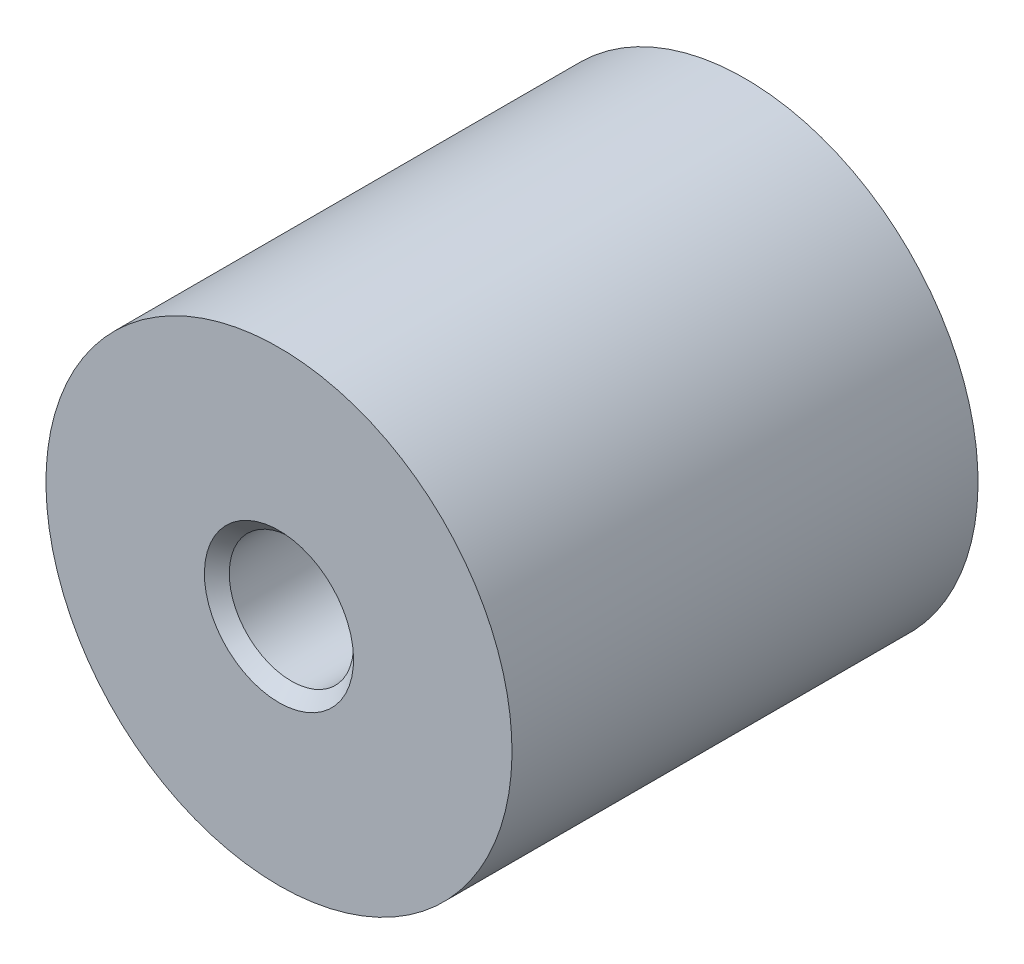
ISO-10303-21;
HEADER;
FILE_DESCRIPTION(('STEP AP214'),'2;1');
FILE_NAME('part.step','',(''),(''),'','','');
FILE_SCHEMA(('AUTOMOTIVE_DESIGN { 1 0 10303 214 1 1 1 1 }'));
ENDSEC;
DATA;
#1=APPLICATION_CONTEXT('core data for automotive mechanical design processes');
#2=APPLICATION_PROTOCOL_DEFINITION('international standard','automotive_design',2000,#1);
#3=PRODUCT_CONTEXT('',#1,'mechanical');
#4=PRODUCT('Part','Part','',(#3));
#5=PRODUCT_RELATED_PRODUCT_CATEGORY('part','',(#4));
#6=PRODUCT_DEFINITION_FORMATION('','',#4);
#7=PRODUCT_DEFINITION_CONTEXT('part definition',#1,'design');
#8=PRODUCT_DEFINITION('design','',#6,#7);
#9=PRODUCT_DEFINITION_SHAPE('','',#8);
#10=(LENGTH_UNIT() NAMED_UNIT(*) SI_UNIT(.MILLI.,.METRE.));
#11=(NAMED_UNIT(*) PLANE_ANGLE_UNIT() SI_UNIT($,.RADIAN.));
#12=(NAMED_UNIT(*) SI_UNIT($,.STERADIAN.) SOLID_ANGLE_UNIT());
#13=UNCERTAINTY_MEASURE_WITH_UNIT(LENGTH_MEASURE(1.E-05),#10,'distance_accuracy_value','');
#14=(GEOMETRIC_REPRESENTATION_CONTEXT(3) GLOBAL_UNCERTAINTY_ASSIGNED_CONTEXT((#13)) GLOBAL_UNIT_ASSIGNED_CONTEXT((#10,
#11,#12)) REPRESENTATION_CONTEXT('',''));
#15=CARTESIAN_POINT('',(0.,0.,0.));
#16=DIRECTION('',(0.,0.,1.));
#17=DIRECTION('',(1.,0.,0.));
#18=AXIS2_PLACEMENT_3D('',#15,#16,#17);
#19=CARTESIAN_POINT('',(7.,0.,15.));
#20=DIRECTION('',(0.,0.,1.));
#21=DIRECTION('',(0.,-1.,0.));
#22=AXIS2_PLACEMENT_3D('',#19,#20,#21);
#23=PLANE('',#22);
#24=CARTESIAN_POINT('',(0.,0.,15.));
#25=DIRECTION('',(0.,0.,1.));
#26=DIRECTION('',(0.,-1.,0.));
#27=AXIS2_PLACEMENT_3D('',#24,#25,#26);
#28=CIRCLE('',#27,2.4);
#29=CARTESIAN_POINT('',(0.,-2.4,15.));
#30=VERTEX_POINT('',#29);
#31=EDGE_CURVE('E8',#30,#30,#28,.F.);
#32=ORIENTED_EDGE('',*,*,#31,.T.);
#33=EDGE_LOOP('',(#32));
#34=FACE_BOUND('',#33,.T.);
#35=CARTESIAN_POINT('',(0.,0.,15.));
#36=DIRECTION('',(0.,0.,1.));
#37=DIRECTION('',(0.,-1.,0.));
#38=AXIS2_PLACEMENT_3D('',#35,#36,#37);
#39=CIRCLE('',#38,7.5);
#40=CARTESIAN_POINT('',(0.,-7.5,15.));
#41=VERTEX_POINT('',#40);
#42=EDGE_CURVE('E23',#41,#41,#39,.T.);
#43=ORIENTED_EDGE('',*,*,#42,.T.);
#44=EDGE_LOOP('',(#43));
#45=FACE_BOUND('',#44,.T.);
#46=ADVANCED_FACE('F12',(#34,#45),#23,.T.);
#47=CARTESIAN_POINT('',(0.,0.,0.));
#48=DIRECTION('',(0.,0.,1.));
#49=DIRECTION('',(0.,-1.,0.));
#50=AXIS2_PLACEMENT_3D('',#47,#48,#49);
#51=CYLINDRICAL_SURFACE('',#50,7.5);
#52=CARTESIAN_POINT('',(0.,0.,0.));
#53=DIRECTION('',(0.,0.,1.));
#54=DIRECTION('',(0.,-1.,0.));
#55=AXIS2_PLACEMENT_3D('',#52,#53,#54);
#56=CIRCLE('',#55,7.5);
#57=CARTESIAN_POINT('',(0.,-7.5,0.));
#58=VERTEX_POINT('',#57);
#59=EDGE_CURVE('E27',#58,#58,#56,.T.);
#60=ORIENTED_EDGE('',*,*,#59,.T.);
#61=EDGE_LOOP('',(#60));
#62=FACE_BOUND('',#61,.T.);
#63=ORIENTED_EDGE('',*,*,#42,.F.);
#64=EDGE_LOOP('',(#63));
#65=FACE_BOUND('',#64,.T.);
#66=ADVANCED_FACE('F48',(#62,#65),#51,.T.);
#67=CARTESIAN_POINT('',(7.5,0.,0.));
#68=DIRECTION('',(0.,0.,-1.));
#69=DIRECTION('',(0.,1.,0.));
#70=AXIS2_PLACEMENT_3D('',#67,#68,#69);
#71=PLANE('',#70);
#72=ORIENTED_EDGE('',*,*,#59,.F.);
#73=EDGE_LOOP('',(#72));
#74=FACE_BOUND('',#73,.T.);
#75=ADVANCED_FACE('F40',(#74),#71,.T.);
#76=CARTESIAN_POINT('',(0.,0.,12.333333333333));
#77=DIRECTION('',(0.,0.,1.));
#78=DIRECTION('',(0.,-1.,0.));
#79=AXIS2_PLACEMENT_3D('',#76,#77,#78);
#80=CYLINDRICAL_SURFACE('',#79,2.);
#81=CARTESIAN_POINT('',(0.,0.,14.6));
#82=DIRECTION('',(0.,0.,1.));
#83=DIRECTION('',(0.,-1.,0.));
#84=AXIS2_PLACEMENT_3D('',#81,#82,#83);
#85=CIRCLE('',#84,2.);
#86=CARTESIAN_POINT('',(0.,-2.,14.6));
#87=VERTEX_POINT('',#86);
#88=EDGE_CURVE('E19',#87,#87,#85,.T.);
#89=ORIENTED_EDGE('',*,*,#88,.T.);
#90=EDGE_LOOP('',(#89));
#91=FACE_BOUND('',#90,.T.);
#92=CARTESIAN_POINT('',(0.,0.,11.));
#93=DIRECTION('',(0.,0.,1.));
#94=DIRECTION('',(0.,-1.,0.));
#95=AXIS2_PLACEMENT_3D('',#92,#93,#94);
#96=CIRCLE('',#95,2.);
#97=CARTESIAN_POINT('',(0.,-2.,11.));
#98=VERTEX_POINT('',#97);
#99=EDGE_CURVE('E32',#98,#98,#96,.T.);
#100=ORIENTED_EDGE('',*,*,#99,.F.);
#101=EDGE_LOOP('',(#100));
#102=FACE_BOUND('',#101,.T.);
#103=ADVANCED_FACE('F38',(#91,#102),#80,.F.);
#104=CARTESIAN_POINT('',(0.,0.,11.));
#105=DIRECTION('',(0.,0.,1.));
#106=DIRECTION('',(0.,-1.,0.));
#107=AXIS2_PLACEMENT_3D('',#104,#105,#106);
#108=PLANE('',#107);
#109=ORIENTED_EDGE('',*,*,#99,.T.);
#110=EDGE_LOOP('',(#109));
#111=FACE_BOUND('',#110,.T.);
#112=ADVANCED_FACE('F36',(#111),#108,.T.);
#113=CARTESIAN_POINT('',(0.,0.,14.6));
#114=DIRECTION('',(0.,0.,1.));
#115=DIRECTION('',(0.,-1.,0.));
#116=AXIS2_PLACEMENT_3D('',#113,#114,#115);
#117=CONICAL_SURFACE('',#116,2.,0.785398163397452);
#118=ORIENTED_EDGE('',*,*,#31,.F.);
#119=EDGE_LOOP('',(#118));
#120=FACE_BOUND('',#119,.T.);
#121=ORIENTED_EDGE('',*,*,#88,.F.);
#122=EDGE_LOOP('',(#121));
#123=FACE_BOUND('',#122,.T.);
#124=ADVANCED_FACE('F14',(#120,#123),#117,.F.);
#125=CLOSED_SHELL('',(#46,#66,#75,#103,#112,#124));
#126=MANIFOLD_SOLID_BREP('B1',#125);
#127=ADVANCED_BREP_SHAPE_REPRESENTATION('',(#18,#126),#14);
#128=SHAPE_DEFINITION_REPRESENTATION(#9,#127);
ENDSEC;
END-ISO-10303-21;
